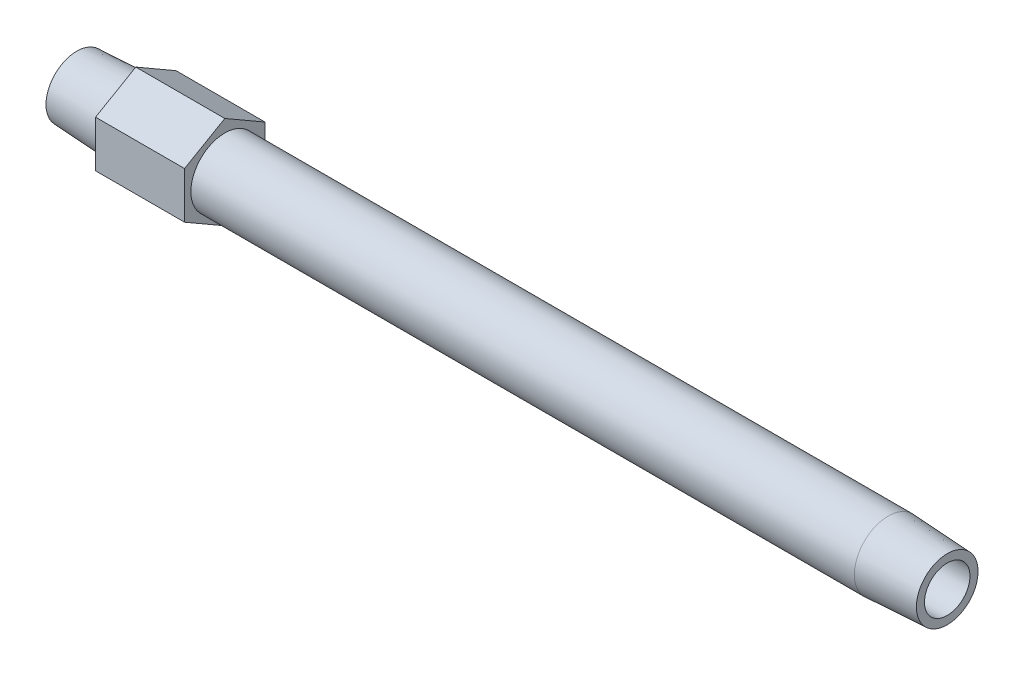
ISO-10303-21;
HEADER;
FILE_DESCRIPTION(('STEP AP214'),'2;1');
FILE_NAME('part.step','',(''),(''),'','','');
FILE_SCHEMA(('AUTOMOTIVE_DESIGN { 1 0 10303 214 1 1 1 1 }'));
ENDSEC;
DATA;
#1=APPLICATION_CONTEXT('core data for automotive mechanical design processes');
#2=APPLICATION_PROTOCOL_DEFINITION('international standard','automotive_design',2000,#1);
#3=PRODUCT_CONTEXT('',#1,'mechanical');
#4=PRODUCT('Part','Part','',(#3));
#5=PRODUCT_RELATED_PRODUCT_CATEGORY('part','',(#4));
#6=PRODUCT_DEFINITION_FORMATION('','',#4);
#7=PRODUCT_DEFINITION_CONTEXT('part definition',#1,'design');
#8=PRODUCT_DEFINITION('design','',#6,#7);
#9=PRODUCT_DEFINITION_SHAPE('','',#8);
#10=(LENGTH_UNIT() NAMED_UNIT(*) SI_UNIT(.MILLI.,.METRE.));
#11=(NAMED_UNIT(*) PLANE_ANGLE_UNIT() SI_UNIT($,.RADIAN.));
#12=(NAMED_UNIT(*) SI_UNIT($,.STERADIAN.) SOLID_ANGLE_UNIT());
#13=UNCERTAINTY_MEASURE_WITH_UNIT(LENGTH_MEASURE(1.E-05),#10,'distance_accuracy_value','');
#14=(GEOMETRIC_REPRESENTATION_CONTEXT(3) GLOBAL_UNCERTAINTY_ASSIGNED_CONTEXT((#13)) GLOBAL_UNIT_ASSIGNED_CONTEXT((#10,
#11,#12)) REPRESENTATION_CONTEXT('',''));
#15=CARTESIAN_POINT('',(0.,0.,0.));
#16=DIRECTION('',(0.,0.,1.));
#17=DIRECTION('',(1.,0.,0.));
#18=AXIS2_PLACEMENT_3D('',#15,#16,#17);
#19=CARTESIAN_POINT('',(0.,0.,-3.59899397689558));
#20=DIRECTION('',(1.,0.,0.));
#21=DIRECTION('',(0.,0.,-1.));
#22=AXIS2_PLACEMENT_3D('',#19,#20,#21);
#23=PLANE('',#22);
#24=CARTESIAN_POINT('',(0.,0.,0.));
#25=DIRECTION('',(-1.,0.,0.));
#26=DIRECTION('',(0.,0.,1.));
#27=AXIS2_PLACEMENT_3D('',#24,#25,#26);
#28=CIRCLE('',#27,3.59899397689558);
#29=CARTESIAN_POINT('',(0.,0.,3.59899397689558));
#30=VERTEX_POINT('',#29);
#31=EDGE_CURVE('E147',#30,#30,#28,.T.);
#32=ORIENTED_EDGE('',*,*,#31,.T.);
#33=EDGE_LOOP('',(#32));
#34=FACE_BOUND('',#33,.T.);
#35=CARTESIAN_POINT('',(0.,0.,0.));
#36=DIRECTION('',(1.,0.,0.));
#37=DIRECTION('',(0.,0.,1.));
#38=AXIS2_PLACEMENT_3D('',#35,#36,#37);
#39=CIRCLE('',#38,2.6543);
#40=CARTESIAN_POINT('',(0.,0.,2.6543));
#41=VERTEX_POINT('',#40);
#42=EDGE_CURVE('E159',#41,#41,#39,.T.);
#43=ORIENTED_EDGE('',*,*,#42,.T.);
#44=EDGE_LOOP('',(#43));
#45=FACE_BOUND('',#44,.T.);
#46=ADVANCED_FACE('F15',(#34,#45),#23,.F.);
#47=CARTESIAN_POINT('',(101.6,0.,-3.59899397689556));
#48=DIRECTION('',(-1.,0.,0.));
#49=DIRECTION('',(0.,0.,1.));
#50=AXIS2_PLACEMENT_3D('',#47,#48,#49);
#51=PLANE('',#50);
#52=CARTESIAN_POINT('',(101.6,0.,0.));
#53=DIRECTION('',(-1.,0.,0.));
#54=DIRECTION('',(0.,0.,1.));
#55=AXIS2_PLACEMENT_3D('',#52,#53,#54);
#56=CIRCLE('',#55,3.59899397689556);
#57=CARTESIAN_POINT('',(101.6,0.,3.59899397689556));
#58=VERTEX_POINT('',#57);
#59=EDGE_CURVE('E150',#58,#58,#56,.T.);
#60=ORIENTED_EDGE('',*,*,#59,.F.);
#61=EDGE_LOOP('',(#60));
#62=FACE_BOUND('',#61,.T.);
#63=CARTESIAN_POINT('',(101.6,0.,0.));
#64=DIRECTION('',(-1.,0.,0.));
#65=DIRECTION('',(0.,0.,1.));
#66=AXIS2_PLACEMENT_3D('',#63,#64,#65);
#67=CIRCLE('',#66,2.6543);
#68=CARTESIAN_POINT('',(101.6,0.,2.6543));
#69=VERTEX_POINT('',#68);
#70=EDGE_CURVE('E156',#69,#69,#67,.F.);
#71=ORIENTED_EDGE('',*,*,#70,.F.);
#72=EDGE_LOOP('',(#71));
#73=FACE_BOUND('',#72,.T.);
#74=ADVANCED_FACE('F178',(#62,#73),#51,.F.);
#75=CARTESIAN_POINT('',(17.272,-2.71296891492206,-4.699));
#76=DIRECTION('',(1.,0.,0.));
#77=DIRECTION('',(0.,1.,0.));
#78=AXIS2_PLACEMENT_3D('',#75,#76,#77);
#79=PLANE('',#78);
#80=DIRECTION('',(0.,0.5,-0.866025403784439));
#81=VECTOR('',#80,1.);
#82=CARTESIAN_POINT('',(17.272,-5.4259378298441,0.));
#83=LINE('',#82,#81);
#84=CARTESIAN_POINT('',(17.272,-5.4259378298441,0.));
#85=VERTEX_POINT('',#84);
#86=CARTESIAN_POINT('',(17.272,-2.71296891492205,-4.699));
#87=VERTEX_POINT('',#86);
#88=EDGE_CURVE('E103',#85,#87,#83,.T.);
#89=ORIENTED_EDGE('',*,*,#88,.T.);
#90=DIRECTION('',(0.,1.,0.));
#91=VECTOR('',#90,1.);
#92=CARTESIAN_POINT('',(17.272,-2.71296891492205,-4.699));
#93=LINE('',#92,#91);
#94=CARTESIAN_POINT('',(17.272,2.71296891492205,-4.699));
#95=VERTEX_POINT('',#94);
#96=EDGE_CURVE('E83',#87,#95,#93,.T.);
#97=ORIENTED_EDGE('',*,*,#96,.T.);
#98=DIRECTION('',(0.,0.5,0.866025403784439));
#99=VECTOR('',#98,1.);
#100=CARTESIAN_POINT('',(17.272,2.71296891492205,-4.699));
#101=LINE('',#100,#99);
#102=CARTESIAN_POINT('',(17.272,5.4259378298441,0.));
#103=VERTEX_POINT('',#102);
#104=EDGE_CURVE('E102',#95,#103,#101,.T.);
#105=ORIENTED_EDGE('',*,*,#104,.T.);
#106=DIRECTION('',(0.,-0.5,0.866025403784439));
#107=VECTOR('',#106,1.);
#108=CARTESIAN_POINT('',(17.272,5.4259378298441,0.));
#109=LINE('',#108,#107);
#110=CARTESIAN_POINT('',(17.272,2.71296891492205,4.699));
#111=VERTEX_POINT('',#110);
#112=EDGE_CURVE('E105',#103,#111,#109,.T.);
#113=ORIENTED_EDGE('',*,*,#112,.T.);
#114=DIRECTION('',(0.,-1.,0.));
#115=VECTOR('',#114,1.);
#116=CARTESIAN_POINT('',(17.272,2.71296891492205,4.699));
#117=LINE('',#116,#115);
#118=CARTESIAN_POINT('',(17.272,-2.71296891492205,4.699));
#119=VERTEX_POINT('',#118);
#120=EDGE_CURVE('E35',#111,#119,#117,.T.);
#121=ORIENTED_EDGE('',*,*,#120,.T.);
#122=DIRECTION('',(0.,-0.5,-0.866025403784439));
#123=VECTOR('',#122,1.);
#124=CARTESIAN_POINT('',(17.272,-2.71296891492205,4.699));
#125=LINE('',#124,#123);
#126=EDGE_CURVE('E30',#119,#85,#125,.T.);
#127=ORIENTED_EDGE('',*,*,#126,.T.);
#128=EDGE_LOOP('',(#89,#97,#105,#113,#121,#127));
#129=FACE_BOUND('',#128,.T.);
#130=CARTESIAN_POINT('',(17.272,0.,0.));
#131=DIRECTION('',(1.,0.,0.));
#132=DIRECTION('',(0.,1.,0.));
#133=AXIS2_PLACEMENT_3D('',#130,#131,#132);
#134=CIRCLE('',#133,3.95973768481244);
#135=CARTESIAN_POINT('',(17.272,3.95973768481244,0.));
#136=VERTEX_POINT('',#135);
#137=EDGE_CURVE('E89',#136,#136,#134,.F.);
#138=ORIENTED_EDGE('',*,*,#137,.T.);
#139=EDGE_LOOP('',(#138));
#140=FACE_BOUND('',#139,.T.);
#141=ADVANCED_FACE('F124',(#129,#140),#79,.T.);
#142=CARTESIAN_POINT('',(6.8834,-2.71296891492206,-4.699));
#143=DIRECTION('',(1.,0.,0.));
#144=DIRECTION('',(0.,1.,0.));
#145=AXIS2_PLACEMENT_3D('',#142,#143,#144);
#146=PLANE('',#145);
#147=DIRECTION('',(0.,0.5,-0.866025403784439));
#148=VECTOR('',#147,1.);
#149=CARTESIAN_POINT('',(6.8834,-5.4259378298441,0.));
#150=LINE('',#149,#148);
#151=CARTESIAN_POINT('',(6.8834,-5.4259378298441,0.));
#152=VERTEX_POINT('',#151);
#153=CARTESIAN_POINT('',(6.8834,-2.71296891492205,-4.699));
#154=VERTEX_POINT('',#153);
#155=EDGE_CURVE('E73',#152,#154,#150,.T.);
#156=ORIENTED_EDGE('',*,*,#155,.F.);
#157=DIRECTION('',(0.,-0.5,-0.866025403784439));
#158=VECTOR('',#157,1.);
#159=CARTESIAN_POINT('',(6.8834,-2.71296891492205,4.699));
#160=LINE('',#159,#158);
#161=CARTESIAN_POINT('',(6.8834,-2.71296891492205,4.699));
#162=VERTEX_POINT('',#161);
#163=EDGE_CURVE('E99',#162,#152,#160,.T.);
#164=ORIENTED_EDGE('',*,*,#163,.F.);
#165=DIRECTION('',(0.,-1.,0.));
#166=VECTOR('',#165,1.);
#167=CARTESIAN_POINT('',(6.8834,2.71296891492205,4.699));
#168=LINE('',#167,#166);
#169=CARTESIAN_POINT('',(6.8834,2.71296891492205,4.699));
#170=VERTEX_POINT('',#169);
#171=EDGE_CURVE('E133',#170,#162,#168,.T.);
#172=ORIENTED_EDGE('',*,*,#171,.F.);
#173=DIRECTION('',(0.,-0.5,0.866025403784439));
#174=VECTOR('',#173,1.);
#175=CARTESIAN_POINT('',(6.8834,5.4259378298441,0.));
#176=LINE('',#175,#174);
#177=CARTESIAN_POINT('',(6.8834,5.4259378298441,0.));
#178=VERTEX_POINT('',#177);
#179=EDGE_CURVE('E129',#178,#170,#176,.T.);
#180=ORIENTED_EDGE('',*,*,#179,.F.);
#181=DIRECTION('',(0.,0.5,0.866025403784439));
#182=VECTOR('',#181,1.);
#183=CARTESIAN_POINT('',(6.8834,2.71296891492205,-4.699));
#184=LINE('',#183,#182);
#185=CARTESIAN_POINT('',(6.8834,2.71296891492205,-4.699));
#186=VERTEX_POINT('',#185);
#187=EDGE_CURVE('E75',#186,#178,#184,.T.);
#188=ORIENTED_EDGE('',*,*,#187,.F.);
#189=DIRECTION('',(0.,1.,0.));
#190=VECTOR('',#189,1.);
#191=CARTESIAN_POINT('',(6.8834,-2.71296891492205,-4.699));
#192=LINE('',#191,#190);
#193=EDGE_CURVE('E68',#154,#186,#192,.T.);
#194=ORIENTED_EDGE('',*,*,#193,.F.);
#195=EDGE_LOOP('',(#156,#164,#172,#180,#188,#194));
#196=FACE_BOUND('',#195,.T.);
#197=CARTESIAN_POINT('',(6.8834,0.,0.));
#198=DIRECTION('',(-1.,0.,0.));
#199=DIRECTION('',(0.,0.,1.));
#200=AXIS2_PLACEMENT_3D('',#197,#198,#199);
#201=CIRCLE('',#200,3.95973768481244);
#202=CARTESIAN_POINT('',(6.8834,0.,3.95973768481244));
#203=VERTEX_POINT('',#202);
#204=EDGE_CURVE('E95',#203,#203,#201,.T.);
#205=ORIENTED_EDGE('',*,*,#204,.F.);
#206=EDGE_LOOP('',(#205));
#207=FACE_BOUND('',#206,.T.);
#208=ADVANCED_FACE('F69',(#196,#207),#146,.F.);
#209=CARTESIAN_POINT('',(17.272,-5.4259378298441,0.));
#210=DIRECTION('',(0.,0.866025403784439,0.5));
#211=DIRECTION('',(0.,-0.5,0.866025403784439));
#212=AXIS2_PLACEMENT_3D('',#209,#210,#211);
#213=PLANE('',#212);
#214=ORIENTED_EDGE('',*,*,#155,.T.);
#215=DIRECTION('',(-1.,0.,0.));
#216=VECTOR('',#215,1.);
#217=CARTESIAN_POINT('',(17.272,-2.71296891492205,-4.699));
#218=LINE('',#217,#216);
#219=EDGE_CURVE('E10',#87,#154,#218,.T.);
#220=ORIENTED_EDGE('',*,*,#219,.F.);
#221=ORIENTED_EDGE('',*,*,#88,.F.);
#222=DIRECTION('',(-1.,0.,0.));
#223=VECTOR('',#222,1.);
#224=CARTESIAN_POINT('',(17.272,-5.4259378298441,0.));
#225=LINE('',#224,#223);
#226=EDGE_CURVE('E87',#85,#152,#225,.T.);
#227=ORIENTED_EDGE('',*,*,#226,.T.);
#228=EDGE_LOOP('',(#214,#220,#221,#227));
#229=FACE_BOUND('',#228,.T.);
#230=ADVANCED_FACE('F17',(#229),#213,.F.);
#231=CARTESIAN_POINT('',(17.272,-2.71296891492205,-4.699));
#232=DIRECTION('',(0.,0.,1.));
#233=DIRECTION('',(1.,0.,0.));
#234=AXIS2_PLACEMENT_3D('',#231,#232,#233);
#235=PLANE('',#234);
#236=ORIENTED_EDGE('',*,*,#193,.T.);
#237=DIRECTION('',(-1.,0.,0.));
#238=VECTOR('',#237,1.);
#239=CARTESIAN_POINT('',(17.272,2.71296891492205,-4.699));
#240=LINE('',#239,#238);
#241=EDGE_CURVE('E23',#95,#186,#240,.T.);
#242=ORIENTED_EDGE('',*,*,#241,.F.);
#243=ORIENTED_EDGE('',*,*,#96,.F.);
#244=ORIENTED_EDGE('',*,*,#219,.T.);
#245=EDGE_LOOP('',(#236,#242,#243,#244));
#246=FACE_BOUND('',#245,.T.);
#247=ADVANCED_FACE('F82',(#246),#235,.F.);
#248=CARTESIAN_POINT('',(17.272,2.71296891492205,-4.699));
#249=DIRECTION('',(0.,-0.866025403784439,0.5));
#250=DIRECTION('',(0.,-0.5,-0.866025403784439));
#251=AXIS2_PLACEMENT_3D('',#248,#249,#250);
#252=PLANE('',#251);
#253=ORIENTED_EDGE('',*,*,#187,.T.);
#254=DIRECTION('',(-1.,0.,0.));
#255=VECTOR('',#254,1.);
#256=CARTESIAN_POINT('',(17.272,5.4259378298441,0.));
#257=LINE('',#256,#255);
#258=EDGE_CURVE('E117',#103,#178,#257,.T.);
#259=ORIENTED_EDGE('',*,*,#258,.F.);
#260=ORIENTED_EDGE('',*,*,#104,.F.);
#261=ORIENTED_EDGE('',*,*,#241,.T.);
#262=EDGE_LOOP('',(#253,#259,#260,#261));
#263=FACE_BOUND('',#262,.T.);
#264=ADVANCED_FACE('F121',(#263),#252,.F.);
#265=CARTESIAN_POINT('',(17.272,5.4259378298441,0.));
#266=DIRECTION('',(0.,-0.866025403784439,-0.5));
#267=DIRECTION('',(0.,0.5,-0.866025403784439));
#268=AXIS2_PLACEMENT_3D('',#265,#266,#267);
#269=PLANE('',#268);
#270=ORIENTED_EDGE('',*,*,#179,.T.);
#271=DIRECTION('',(-1.,0.,0.));
#272=VECTOR('',#271,1.);
#273=CARTESIAN_POINT('',(17.272,2.71296891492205,4.699));
#274=LINE('',#273,#272);
#275=EDGE_CURVE('E114',#111,#170,#274,.T.);
#276=ORIENTED_EDGE('',*,*,#275,.F.);
#277=ORIENTED_EDGE('',*,*,#112,.F.);
#278=ORIENTED_EDGE('',*,*,#258,.T.);
#279=EDGE_LOOP('',(#270,#276,#277,#278));
#280=FACE_BOUND('',#279,.T.);
#281=ADVANCED_FACE('F128',(#280),#269,.F.);
#282=CARTESIAN_POINT('',(17.272,2.71296891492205,4.699));
#283=DIRECTION('',(0.,0.,-1.));
#284=DIRECTION('',(-1.,0.,0.));
#285=AXIS2_PLACEMENT_3D('',#282,#283,#284);
#286=PLANE('',#285);
#287=ORIENTED_EDGE('',*,*,#171,.T.);
#288=DIRECTION('',(-1.,0.,0.));
#289=VECTOR('',#288,1.);
#290=CARTESIAN_POINT('',(17.272,-2.71296891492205,4.699));
#291=LINE('',#290,#289);
#292=EDGE_CURVE('E111',#119,#162,#291,.T.);
#293=ORIENTED_EDGE('',*,*,#292,.F.);
#294=ORIENTED_EDGE('',*,*,#120,.F.);
#295=ORIENTED_EDGE('',*,*,#275,.T.);
#296=EDGE_LOOP('',(#287,#293,#294,#295));
#297=FACE_BOUND('',#296,.T.);
#298=ADVANCED_FACE('F132',(#297),#286,.F.);
#299=CARTESIAN_POINT('',(17.272,-2.71296891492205,4.699));
#300=DIRECTION('',(0.,0.866025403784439,-0.5));
#301=DIRECTION('',(0.,0.5,0.866025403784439));
#302=AXIS2_PLACEMENT_3D('',#299,#300,#301);
#303=PLANE('',#302);
#304=ORIENTED_EDGE('',*,*,#163,.T.);
#305=ORIENTED_EDGE('',*,*,#226,.F.);
#306=ORIENTED_EDGE('',*,*,#126,.F.);
#307=ORIENTED_EDGE('',*,*,#292,.T.);
#308=EDGE_LOOP('',(#304,#305,#306,#307));
#309=FACE_BOUND('',#308,.T.);
#310=ADVANCED_FACE('F135',(#309),#303,.F.);
#311=CARTESIAN_POINT('',(6.8834,0.,0.));
#312=DIRECTION('',(1.,0.,0.));
#313=DIRECTION('',(0.,0.,-1.));
#314=AXIS2_PLACEMENT_3D('',#311,#312,#313);
#315=CONICAL_SURFACE('',#314,3.95973768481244,0.0523598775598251);
#316=ORIENTED_EDGE('',*,*,#31,.F.);
#317=EDGE_LOOP('',(#316));
#318=FACE_BOUND('',#317,.T.);
#319=ORIENTED_EDGE('',*,*,#204,.T.);
#320=EDGE_LOOP('',(#319));
#321=FACE_BOUND('',#320,.T.);
#322=ADVANCED_FACE('F187',(#318,#321),#315,.T.);
#323=CARTESIAN_POINT('',(-60.,0.,0.));
#324=DIRECTION('',(-1.,0.,0.));
#325=DIRECTION('',(0.,0.,1.));
#326=AXIS2_PLACEMENT_3D('',#323,#324,#325);
#327=CYLINDRICAL_SURFACE('',#326,3.95973768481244);
#328=ORIENTED_EDGE('',*,*,#137,.F.);
#329=EDGE_LOOP('',(#328));
#330=FACE_BOUND('',#329,.T.);
#331=CARTESIAN_POINT('',(94.7166,0.,0.));
#332=DIRECTION('',(-1.,0.,0.));
#333=DIRECTION('',(0.,0.,1.));
#334=AXIS2_PLACEMENT_3D('',#331,#332,#333);
#335=CIRCLE('',#334,3.95973768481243);
#336=CARTESIAN_POINT('',(94.7166,0.,3.95973768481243));
#337=VERTEX_POINT('',#336);
#338=EDGE_CURVE('E153',#337,#337,#335,.T.);
#339=ORIENTED_EDGE('',*,*,#338,.T.);
#340=EDGE_LOOP('',(#339));
#341=FACE_BOUND('',#340,.T.);
#342=ADVANCED_FACE('F174',(#330,#341),#327,.T.);
#343=CARTESIAN_POINT('',(101.6,0.,0.));
#344=DIRECTION('',(-1.,0.,0.));
#345=DIRECTION('',(0.,0.,1.));
#346=AXIS2_PLACEMENT_3D('',#343,#344,#345);
#347=CONICAL_SURFACE('',#346,3.59899397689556,0.0523598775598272);
#348=ORIENTED_EDGE('',*,*,#338,.F.);
#349=EDGE_LOOP('',(#348));
#350=FACE_BOUND('',#349,.T.);
#351=ORIENTED_EDGE('',*,*,#59,.T.);
#352=EDGE_LOOP('',(#351));
#353=FACE_BOUND('',#352,.T.);
#354=ADVANCED_FACE('F167',(#350,#353),#347,.T.);
#355=CARTESIAN_POINT('',(102.60918871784,0.,0.));
#356=DIRECTION('',(-1.,0.,0.));
#357=DIRECTION('',(0.,0.,1.));
#358=AXIS2_PLACEMENT_3D('',#355,#356,#357);
#359=CYLINDRICAL_SURFACE('',#358,2.6543);
#360=ORIENTED_EDGE('',*,*,#70,.T.);
#361=EDGE_LOOP('',(#360));
#362=FACE_BOUND('',#361,.T.);
#363=ORIENTED_EDGE('',*,*,#42,.F.);
#364=EDGE_LOOP('',(#363));
#365=FACE_BOUND('',#364,.T.);
#366=ADVANCED_FACE('F165',(#362,#365),#359,.F.);
#367=CLOSED_SHELL('',(#46,#74,#141,#208,#230,#247,#264,#281,#298,#310,#322,#342,#354,#366));
#368=MANIFOLD_SOLID_BREP('B1',#367);
#369=ADVANCED_BREP_SHAPE_REPRESENTATION('',(#18,#368),#14);
#370=SHAPE_DEFINITION_REPRESENTATION(#9,#369);
ENDSEC;
END-ISO-10303-21;
